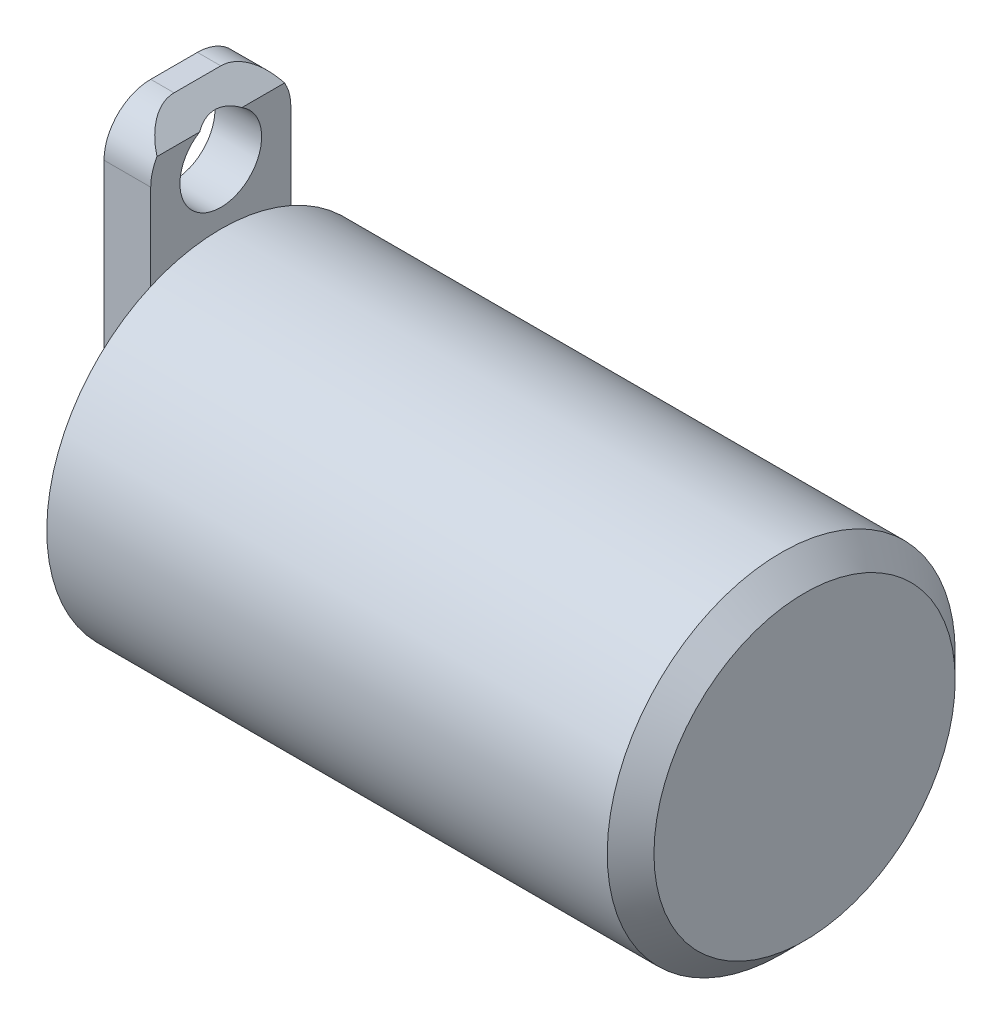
from build123d import *

# Parameters (mm, degrees)
SKETCH1_R           = 14.9
BOSS_EXTRUDE1_DEPTH = 50
CHAMFER1_SIZE       = 2
SKETCH2_R           = 3.5
BOSS_EXTRUDE2_DEPTH = 4
CUT_EXTRUDE1_DEPTH  = 60.680901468


with BuildPart() as part:
    # Sketch1 → Boss-Extrude1 (new body)
    with BuildSketch(Plane(origin=(0, 0, 0), x_dir=(0, 0, -1), z_dir=(1, 0, 0))):
        Circle(SKETCH1_R)
    extrude(amount=BOSS_EXTRUDE1_DEPTH)

    # Chamfer1
    chamfer1_edges = [part.edges().sort_by_distance(p)[0] for p in [
        (50, 0, 14.9),
    ]]
    chamfer(chamfer1_edges, length=CHAMFER1_SIZE)

    # Sketch2 → Boss-Extrude2 (add)
    with BuildSketch(Plane.ZY):
        with BuildLine():
            Line((0, 0), (6, 0))
            Line((6, 0), (6, 21))
            ThreePointArc((6, 21), (4.828427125, 23.828427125), (2, 25))
            Line((2, 25), (-2, 25))
            ThreePointArc((-2, 25), (-4.828427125, 23.828427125), (-6, 21))
            Line((-6, 21), (-6, 0))
            Line((-6, 0), (0, 0))
        make_face()
        with Locations((0, 20)):
            Circle(SKETCH2_R, mode=Mode.SUBTRACT)
    extrude(amount=BOSS_EXTRUDE2_DEPTH)

    # Sketch3 → Cut-Extrude1 (cut, through all)
    with BuildSketch(Plane.XY.offset(6)):
        Polygon((0, 25), (-2, 25), (0, 23), align=None)
    extrude(amount=-CUT_EXTRUDE1_DEPTH, mode=Mode.SUBTRACT)


solid = part.part
